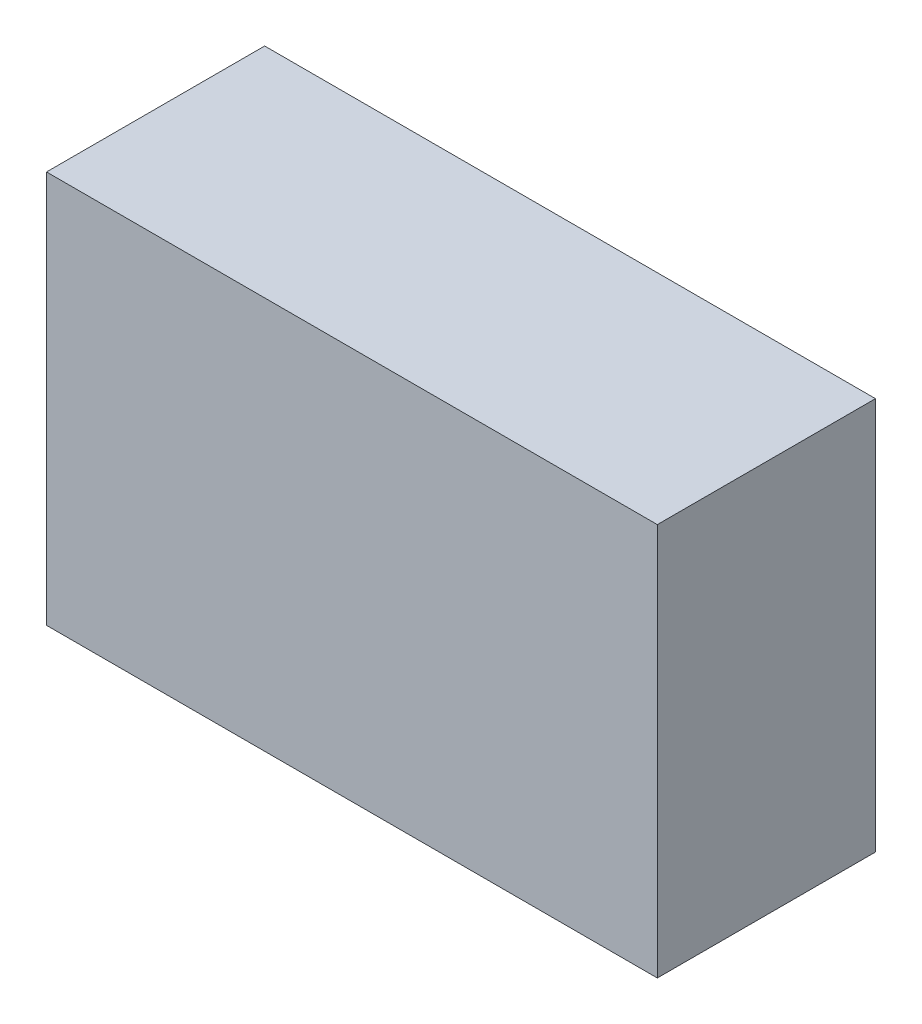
ISO-10303-21;
HEADER;
FILE_DESCRIPTION(('STEP AP214'),'2;1');
FILE_NAME('part.step','',(''),(''),'','','');
FILE_SCHEMA(('AUTOMOTIVE_DESIGN { 1 0 10303 214 1 1 1 1 }'));
ENDSEC;
DATA;
#1=APPLICATION_CONTEXT('core data for automotive mechanical design processes');
#2=APPLICATION_PROTOCOL_DEFINITION('international standard','automotive_design',2000,#1);
#3=PRODUCT_CONTEXT('',#1,'mechanical');
#4=PRODUCT('Part','Part','',(#3));
#5=PRODUCT_RELATED_PRODUCT_CATEGORY('part','',(#4));
#6=PRODUCT_DEFINITION_FORMATION('','',#4);
#7=PRODUCT_DEFINITION_CONTEXT('part definition',#1,'design');
#8=PRODUCT_DEFINITION('design','',#6,#7);
#9=PRODUCT_DEFINITION_SHAPE('','',#8);
#10=(LENGTH_UNIT() NAMED_UNIT(*) SI_UNIT(.MILLI.,.METRE.));
#11=(NAMED_UNIT(*) PLANE_ANGLE_UNIT() SI_UNIT($,.RADIAN.));
#12=(NAMED_UNIT(*) SI_UNIT($,.STERADIAN.) SOLID_ANGLE_UNIT());
#13=UNCERTAINTY_MEASURE_WITH_UNIT(LENGTH_MEASURE(1.E-05),#10,'distance_accuracy_value','');
#14=(GEOMETRIC_REPRESENTATION_CONTEXT(3) GLOBAL_UNCERTAINTY_ASSIGNED_CONTEXT((#13)) GLOBAL_UNIT_ASSIGNED_CONTEXT((#10,
#11,#12)) REPRESENTATION_CONTEXT('',''));
#15=CARTESIAN_POINT('',(0.,0.,0.));
#16=DIRECTION('',(0.,0.,1.));
#17=DIRECTION('',(1.,0.,0.));
#18=AXIS2_PLACEMENT_3D('',#15,#16,#17);
#19=CARTESIAN_POINT('',(0.,0.,25.));
#20=DIRECTION('',(1.,0.,0.));
#21=DIRECTION('',(0.,1.,0.));
#22=AXIS2_PLACEMENT_3D('',#19,#20,#21);
#23=PLANE('',#22);
#24=DIRECTION('',(0.,-1.,0.));
#25=VECTOR('',#24,1.);
#26=CARTESIAN_POINT('',(0.,0.,0.));
#27=LINE('',#26,#25);
#28=CARTESIAN_POINT('',(0.,45.,0.));
#29=VERTEX_POINT('',#28);
#30=CARTESIAN_POINT('',(0.,0.,0.));
#31=VERTEX_POINT('',#30);
#32=EDGE_CURVE('E94',#29,#31,#27,.T.);
#33=ORIENTED_EDGE('',*,*,#32,.T.);
#34=DIRECTION('',(0.,0.,-1.));
#35=VECTOR('',#34,1.);
#36=CARTESIAN_POINT('',(0.,0.,25.));
#37=LINE('',#36,#35);
#38=CARTESIAN_POINT('',(0.,0.,25.));
#39=VERTEX_POINT('',#38);
#40=EDGE_CURVE('E11',#39,#31,#37,.T.);
#41=ORIENTED_EDGE('',*,*,#40,.F.);
#42=DIRECTION('',(0.,-1.,0.));
#43=VECTOR('',#42,1.);
#44=CARTESIAN_POINT('',(0.,0.,25.));
#45=LINE('',#44,#43);
#46=CARTESIAN_POINT('',(0.,45.,25.));
#47=VERTEX_POINT('',#46);
#48=EDGE_CURVE('E82',#47,#39,#45,.T.);
#49=ORIENTED_EDGE('',*,*,#48,.F.);
#50=DIRECTION('',(0.,0.,-1.));
#51=VECTOR('',#50,1.);
#52=CARTESIAN_POINT('',(0.,45.,25.));
#53=LINE('',#52,#51);
#54=EDGE_CURVE('E90',#47,#29,#53,.T.);
#55=ORIENTED_EDGE('',*,*,#54,.T.);
#56=EDGE_LOOP('',(#33,#41,#49,#55));
#57=FACE_BOUND('',#56,.T.);
#58=ADVANCED_FACE('F31',(#57),#23,.F.);
#59=CARTESIAN_POINT('',(0.,0.,25.));
#60=DIRECTION('',(0.,1.,0.));
#61=DIRECTION('',(0.,0.,1.));
#62=AXIS2_PLACEMENT_3D('',#59,#60,#61);
#63=PLANE('',#62);
#64=DIRECTION('',(1.,0.,0.));
#65=VECTOR('',#64,1.);
#66=CARTESIAN_POINT('',(0.,0.,0.));
#67=LINE('',#66,#65);
#68=CARTESIAN_POINT('',(70.,0.,0.));
#69=VERTEX_POINT('',#68);
#70=EDGE_CURVE('E86',#31,#69,#67,.T.);
#71=ORIENTED_EDGE('',*,*,#70,.T.);
#72=DIRECTION('',(0.,0.,-1.));
#73=VECTOR('',#72,1.);
#74=CARTESIAN_POINT('',(70.,0.,25.));
#75=LINE('',#74,#73);
#76=CARTESIAN_POINT('',(70.,0.,25.));
#77=VERTEX_POINT('',#76);
#78=EDGE_CURVE('E39',#77,#69,#75,.T.);
#79=ORIENTED_EDGE('',*,*,#78,.F.);
#80=DIRECTION('',(1.,0.,0.));
#81=VECTOR('',#80,1.);
#82=CARTESIAN_POINT('',(0.,0.,25.));
#83=LINE('',#82,#81);
#84=EDGE_CURVE('E77',#39,#77,#83,.T.);
#85=ORIENTED_EDGE('',*,*,#84,.F.);
#86=ORIENTED_EDGE('',*,*,#40,.T.);
#87=EDGE_LOOP('',(#71,#79,#85,#86));
#88=FACE_BOUND('',#87,.T.);
#89=ADVANCED_FACE('F85',(#88),#63,.F.);
#90=CARTESIAN_POINT('',(70.,0.,25.));
#91=DIRECTION('',(-1.,0.,0.));
#92=DIRECTION('',(0.,0.,1.));
#93=AXIS2_PLACEMENT_3D('',#90,#91,#92);
#94=PLANE('',#93);
#95=DIRECTION('',(0.,1.,0.));
#96=VECTOR('',#95,1.);
#97=CARTESIAN_POINT('',(70.,0.,0.));
#98=LINE('',#97,#96);
#99=CARTESIAN_POINT('',(70.,45.,0.));
#100=VERTEX_POINT('',#99);
#101=EDGE_CURVE('E64',#69,#100,#98,.T.);
#102=ORIENTED_EDGE('',*,*,#101,.T.);
#103=DIRECTION('',(0.,0.,-1.));
#104=VECTOR('',#103,1.);
#105=CARTESIAN_POINT('',(70.,45.,25.));
#106=LINE('',#105,#104);
#107=CARTESIAN_POINT('',(70.,45.,25.));
#108=VERTEX_POINT('',#107);
#109=EDGE_CURVE('E87',#108,#100,#106,.T.);
#110=ORIENTED_EDGE('',*,*,#109,.F.);
#111=DIRECTION('',(0.,1.,0.));
#112=VECTOR('',#111,1.);
#113=CARTESIAN_POINT('',(70.,0.,25.));
#114=LINE('',#113,#112);
#115=EDGE_CURVE('E80',#77,#108,#114,.T.);
#116=ORIENTED_EDGE('',*,*,#115,.F.);
#117=ORIENTED_EDGE('',*,*,#78,.T.);
#118=EDGE_LOOP('',(#102,#110,#116,#117));
#119=FACE_BOUND('',#118,.T.);
#120=ADVANCED_FACE('F88',(#119),#94,.F.);
#121=CARTESIAN_POINT('',(0.,45.,25.));
#122=DIRECTION('',(0.,-1.,0.));
#123=DIRECTION('',(0.,0.,-1.));
#124=AXIS2_PLACEMENT_3D('',#121,#122,#123);
#125=PLANE('',#124);
#126=DIRECTION('',(-1.,0.,0.));
#127=VECTOR('',#126,1.);
#128=CARTESIAN_POINT('',(0.,45.,0.));
#129=LINE('',#128,#127);
#130=EDGE_CURVE('E70',#100,#29,#129,.T.);
#131=ORIENTED_EDGE('',*,*,#130,.T.);
#132=ORIENTED_EDGE('',*,*,#54,.F.);
#133=DIRECTION('',(-1.,0.,0.));
#134=VECTOR('',#133,1.);
#135=CARTESIAN_POINT('',(0.,45.,25.));
#136=LINE('',#135,#134);
#137=EDGE_CURVE('E47',#108,#47,#136,.T.);
#138=ORIENTED_EDGE('',*,*,#137,.F.);
#139=ORIENTED_EDGE('',*,*,#109,.T.);
#140=EDGE_LOOP('',(#131,#132,#138,#139));
#141=FACE_BOUND('',#140,.T.);
#142=ADVANCED_FACE('F101',(#141),#125,.F.);
#143=CARTESIAN_POINT('',(0.,45.,25.));
#144=DIRECTION('',(0.,0.,-1.));
#145=DIRECTION('',(-1.,0.,0.));
#146=AXIS2_PLACEMENT_3D('',#143,#144,#145);
#147=PLANE('',#146);
#148=ORIENTED_EDGE('',*,*,#48,.T.);
#149=ORIENTED_EDGE('',*,*,#84,.T.);
#150=ORIENTED_EDGE('',*,*,#115,.T.);
#151=ORIENTED_EDGE('',*,*,#137,.T.);
#152=EDGE_LOOP('',(#148,#149,#150,#151));
#153=FACE_BOUND('',#152,.T.);
#154=ADVANCED_FACE('F78',(#153),#147,.F.);
#155=CARTESIAN_POINT('',(0.,45.,0.));
#156=DIRECTION('',(0.,0.,-1.));
#157=DIRECTION('',(-1.,0.,0.));
#158=AXIS2_PLACEMENT_3D('',#155,#156,#157);
#159=PLANE('',#158);
#160=ORIENTED_EDGE('',*,*,#32,.F.);
#161=ORIENTED_EDGE('',*,*,#130,.F.);
#162=ORIENTED_EDGE('',*,*,#101,.F.);
#163=ORIENTED_EDGE('',*,*,#70,.F.);
#164=EDGE_LOOP('',(#160,#161,#162,#163));
#165=FACE_BOUND('',#164,.T.);
#166=ADVANCED_FACE('F104',(#165),#159,.T.);
#167=CLOSED_SHELL('',(#58,#89,#120,#142,#154,#166));
#168=MANIFOLD_SOLID_BREP('B2',#167);
#169=ADVANCED_BREP_SHAPE_REPRESENTATION('',(#18,#168),#14);
#170=SHAPE_DEFINITION_REPRESENTATION(#9,#169);
ENDSEC;
END-ISO-10303-21;
